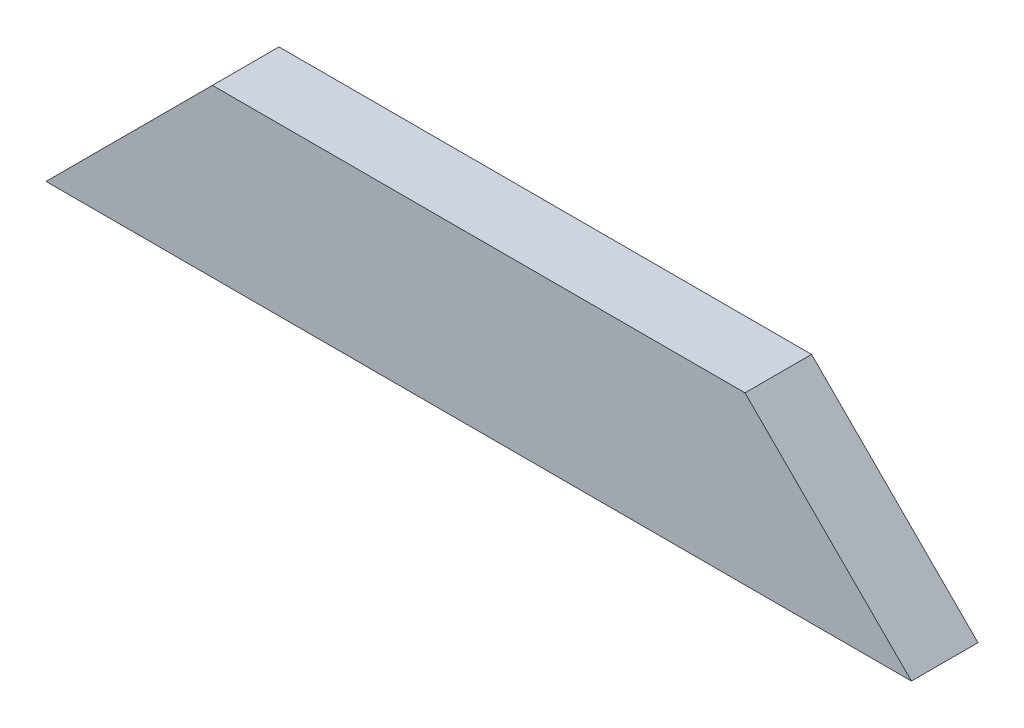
ISO-10303-21;
HEADER;
FILE_DESCRIPTION(('STEP AP214'),'2;1');
FILE_NAME('part.step','',(''),(''),'','','');
FILE_SCHEMA(('AUTOMOTIVE_DESIGN { 1 0 10303 214 1 1 1 1 }'));
ENDSEC;
DATA;
#1=APPLICATION_CONTEXT('core data for automotive mechanical design processes');
#2=APPLICATION_PROTOCOL_DEFINITION('international standard','automotive_design',2000,#1);
#3=PRODUCT_CONTEXT('',#1,'mechanical');
#4=PRODUCT('Part','Part','',(#3));
#5=PRODUCT_RELATED_PRODUCT_CATEGORY('part','',(#4));
#6=PRODUCT_DEFINITION_FORMATION('','',#4);
#7=PRODUCT_DEFINITION_CONTEXT('part definition',#1,'design');
#8=PRODUCT_DEFINITION('design','',#6,#7);
#9=PRODUCT_DEFINITION_SHAPE('','',#8);
#10=(LENGTH_UNIT() NAMED_UNIT(*) SI_UNIT(.MILLI.,.METRE.));
#11=(NAMED_UNIT(*) PLANE_ANGLE_UNIT() SI_UNIT($,.RADIAN.));
#12=(NAMED_UNIT(*) SI_UNIT($,.STERADIAN.) SOLID_ANGLE_UNIT());
#13=UNCERTAINTY_MEASURE_WITH_UNIT(LENGTH_MEASURE(1.E-05),#10,'distance_accuracy_value','');
#14=(GEOMETRIC_REPRESENTATION_CONTEXT(3) GLOBAL_UNCERTAINTY_ASSIGNED_CONTEXT((#13)) GLOBAL_UNIT_ASSIGNED_CONTEXT((#10,
#11,#12)) REPRESENTATION_CONTEXT('',''));
#15=CARTESIAN_POINT('',(0.,0.,0.));
#16=DIRECTION('',(0.,0.,1.));
#17=DIRECTION('',(1.,0.,0.));
#18=AXIS2_PLACEMENT_3D('',#15,#16,#17);
#19=CARTESIAN_POINT('',(-39.9999999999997,25.,-10.));
#20=DIRECTION('',(0.,1.,0.));
#21=DIRECTION('',(0.,0.,1.));
#22=AXIS2_PLACEMENT_3D('',#19,#20,#21);
#23=PLANE('',#22);
#24=DIRECTION('',(-1.,0.,0.));
#25=VECTOR('',#24,1.);
#26=CARTESIAN_POINT('',(-39.9999999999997,25.,0.));
#27=LINE('',#26,#25);
#28=CARTESIAN_POINT('',(39.9999999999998,25.,0.));
#29=VERTEX_POINT('',#28);
#30=CARTESIAN_POINT('',(-39.9999999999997,25.,0.));
#31=VERTEX_POINT('',#30);
#32=EDGE_CURVE('E97',#29,#31,#27,.T.);
#33=ORIENTED_EDGE('',*,*,#32,.F.);
#34=DIRECTION('',(0.,0.,1.));
#35=VECTOR('',#34,1.);
#36=CARTESIAN_POINT('',(39.9999999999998,25.,-10.));
#37=LINE('',#36,#35);
#38=CARTESIAN_POINT('',(39.9999999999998,25.,-10.));
#39=VERTEX_POINT('',#38);
#40=EDGE_CURVE('E11',#39,#29,#37,.T.);
#41=ORIENTED_EDGE('',*,*,#40,.F.);
#42=DIRECTION('',(-1.,0.,0.));
#43=VECTOR('',#42,1.);
#44=CARTESIAN_POINT('',(-39.9999999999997,25.,-10.));
#45=LINE('',#44,#43);
#46=CARTESIAN_POINT('',(-39.9999999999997,25.,-10.));
#47=VERTEX_POINT('',#46);
#48=EDGE_CURVE('E91',#39,#47,#45,.T.);
#49=ORIENTED_EDGE('',*,*,#48,.T.);
#50=DIRECTION('',(0.,0.,1.));
#51=VECTOR('',#50,1.);
#52=CARTESIAN_POINT('',(-39.9999999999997,25.,-10.));
#53=LINE('',#52,#51);
#54=EDGE_CURVE('E36',#47,#31,#53,.T.);
#55=ORIENTED_EDGE('',*,*,#54,.T.);
#56=EDGE_LOOP('',(#33,#41,#49,#55));
#57=FACE_BOUND('',#56,.T.);
#58=ADVANCED_FACE('F33',(#57),#23,.T.);
#59=CARTESIAN_POINT('',(39.9999999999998,25.,-10.));
#60=DIRECTION('',(0.707106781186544,0.707106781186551,0.));
#61=DIRECTION('',(-0.707106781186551,0.707106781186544,0.));
#62=AXIS2_PLACEMENT_3D('',#59,#60,#61);
#63=PLANE('',#62);
#64=DIRECTION('',(-0.707106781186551,0.707106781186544,0.));
#65=VECTOR('',#64,1.);
#66=CARTESIAN_POINT('',(39.9999999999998,25.,0.));
#67=LINE('',#66,#65);
#68=CARTESIAN_POINT('',(65.,0.,0.));
#69=VERTEX_POINT('',#68);
#70=EDGE_CURVE('E93',#69,#29,#67,.T.);
#71=ORIENTED_EDGE('',*,*,#70,.F.);
#72=DIRECTION('',(0.,0.,1.));
#73=VECTOR('',#72,1.);
#74=CARTESIAN_POINT('',(65.,0.,-10.));
#75=LINE('',#74,#73);
#76=CARTESIAN_POINT('',(65.,0.,-10.));
#77=VERTEX_POINT('',#76);
#78=EDGE_CURVE('E42',#77,#69,#75,.T.);
#79=ORIENTED_EDGE('',*,*,#78,.F.);
#80=DIRECTION('',(-0.707106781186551,0.707106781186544,0.));
#81=VECTOR('',#80,1.);
#82=CARTESIAN_POINT('',(39.9999999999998,25.,-10.));
#83=LINE('',#82,#81);
#84=EDGE_CURVE('E88',#77,#39,#83,.T.);
#85=ORIENTED_EDGE('',*,*,#84,.T.);
#86=ORIENTED_EDGE('',*,*,#40,.T.);
#87=EDGE_LOOP('',(#71,#79,#85,#86));
#88=FACE_BOUND('',#87,.T.);
#89=ADVANCED_FACE('F107',(#88),#63,.T.);
#90=CARTESIAN_POINT('',(65.,0.,-10.));
#91=DIRECTION('',(0.,-1.,0.));
#92=DIRECTION('',(0.,0.,-1.));
#93=AXIS2_PLACEMENT_3D('',#90,#91,#92);
#94=PLANE('',#93);
#95=DIRECTION('',(1.,0.,0.));
#96=VECTOR('',#95,1.);
#97=CARTESIAN_POINT('',(65.,0.,0.));
#98=LINE('',#97,#96);
#99=CARTESIAN_POINT('',(-65.,0.,0.));
#100=VERTEX_POINT('',#99);
#101=EDGE_CURVE('E83',#100,#69,#98,.T.);
#102=ORIENTED_EDGE('',*,*,#101,.F.);
#103=DIRECTION('',(0.,0.,1.));
#104=VECTOR('',#103,1.);
#105=CARTESIAN_POINT('',(-65.,0.,-10.));
#106=LINE('',#105,#104);
#107=CARTESIAN_POINT('',(-65.,0.,-10.));
#108=VERTEX_POINT('',#107);
#109=EDGE_CURVE('E78',#108,#100,#106,.T.);
#110=ORIENTED_EDGE('',*,*,#109,.F.);
#111=DIRECTION('',(1.,0.,0.));
#112=VECTOR('',#111,1.);
#113=CARTESIAN_POINT('',(65.,0.,-10.));
#114=LINE('',#113,#112);
#115=EDGE_CURVE('E81',#108,#77,#114,.T.);
#116=ORIENTED_EDGE('',*,*,#115,.T.);
#117=ORIENTED_EDGE('',*,*,#78,.T.);
#118=EDGE_LOOP('',(#102,#110,#116,#117));
#119=FACE_BOUND('',#118,.T.);
#120=ADVANCED_FACE('F80',(#119),#94,.T.);
#121=CARTESIAN_POINT('',(-65.,0.,-10.));
#122=DIRECTION('',(-0.707106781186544,0.707106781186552,0.));
#123=DIRECTION('',(-0.707106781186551,-0.707106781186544,0.));
#124=AXIS2_PLACEMENT_3D('',#121,#122,#123);
#125=PLANE('',#124);
#126=DIRECTION('',(-0.707106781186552,-0.707106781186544,0.));
#127=VECTOR('',#126,1.);
#128=CARTESIAN_POINT('',(-65.,0.,0.));
#129=LINE('',#128,#127);
#130=EDGE_CURVE('E100',#31,#100,#129,.T.);
#131=ORIENTED_EDGE('',*,*,#130,.F.);
#132=ORIENTED_EDGE('',*,*,#54,.F.);
#133=DIRECTION('',(-0.707106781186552,-0.707106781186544,0.));
#134=VECTOR('',#133,1.);
#135=CARTESIAN_POINT('',(-65.,0.,-10.));
#136=LINE('',#135,#134);
#137=EDGE_CURVE('E87',#47,#108,#136,.T.);
#138=ORIENTED_EDGE('',*,*,#137,.T.);
#139=ORIENTED_EDGE('',*,*,#109,.T.);
#140=EDGE_LOOP('',(#131,#132,#138,#139));
#141=FACE_BOUND('',#140,.T.);
#142=ADVANCED_FACE('F90',(#141),#125,.T.);
#143=CARTESIAN_POINT('',(0.,0.,-10.));
#144=DIRECTION('',(0.,0.,-1.));
#145=DIRECTION('',(-1.,0.,0.));
#146=AXIS2_PLACEMENT_3D('',#143,#144,#145);
#147=PLANE('',#146);
#148=ORIENTED_EDGE('',*,*,#48,.F.);
#149=ORIENTED_EDGE('',*,*,#84,.F.);
#150=ORIENTED_EDGE('',*,*,#115,.F.);
#151=ORIENTED_EDGE('',*,*,#137,.F.);
#152=EDGE_LOOP('',(#148,#149,#150,#151));
#153=FACE_BOUND('',#152,.T.);
#154=ADVANCED_FACE('F86',(#153),#147,.T.);
#155=CARTESIAN_POINT('',(0.,0.,0.));
#156=DIRECTION('',(0.,0.,-1.));
#157=DIRECTION('',(-1.,0.,0.));
#158=AXIS2_PLACEMENT_3D('',#155,#156,#157);
#159=PLANE('',#158);
#160=ORIENTED_EDGE('',*,*,#32,.T.);
#161=ORIENTED_EDGE('',*,*,#130,.T.);
#162=ORIENTED_EDGE('',*,*,#101,.T.);
#163=ORIENTED_EDGE('',*,*,#70,.T.);
#164=EDGE_LOOP('',(#160,#161,#162,#163));
#165=FACE_BOUND('',#164,.T.);
#166=ADVANCED_FACE('F106',(#165),#159,.F.);
#167=CLOSED_SHELL('',(#58,#89,#120,#142,#154,#166));
#168=MANIFOLD_SOLID_BREP('B2',#167);
#169=ADVANCED_BREP_SHAPE_REPRESENTATION('',(#18,#168),#14);
#170=SHAPE_DEFINITION_REPRESENTATION(#9,#169);
ENDSEC;
END-ISO-10303-21;
